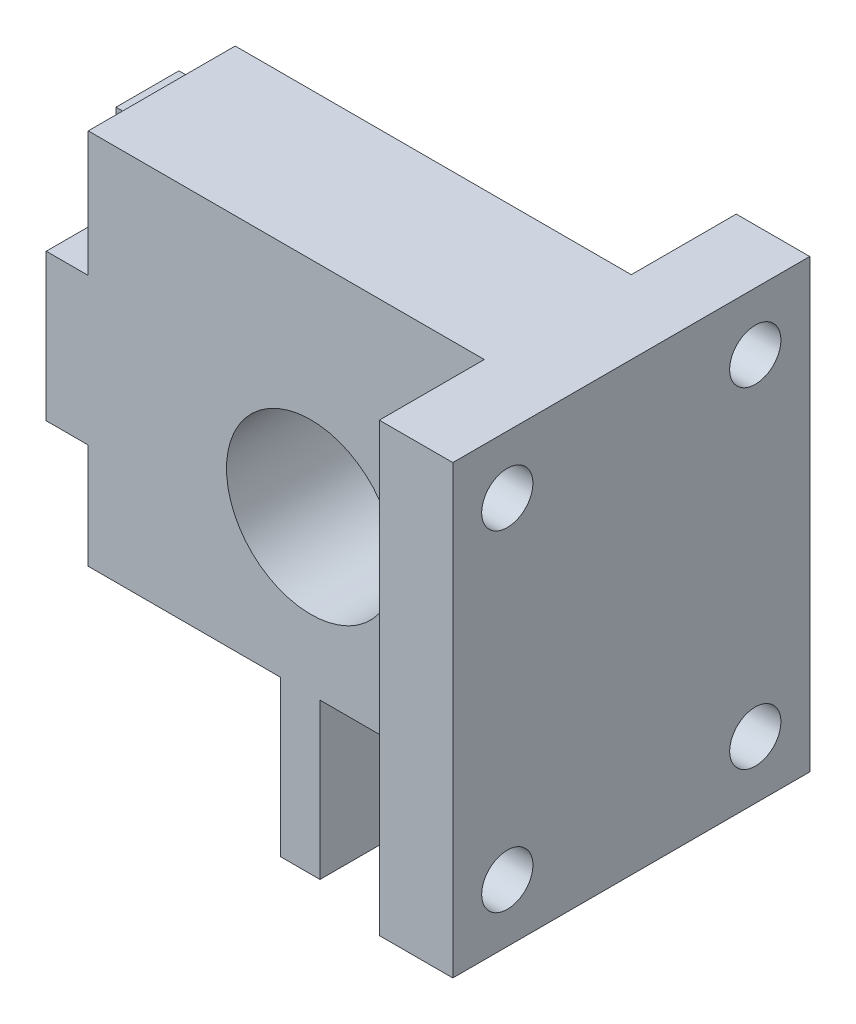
ISO-10303-21;
HEADER;
FILE_DESCRIPTION(('STEP AP214'),'2;1');
FILE_NAME('part.step','',(''),(''),'','','');
FILE_SCHEMA(('AUTOMOTIVE_DESIGN { 1 0 10303 214 1 1 1 1 }'));
ENDSEC;
DATA;
#1=APPLICATION_CONTEXT('core data for automotive mechanical design processes');
#2=APPLICATION_PROTOCOL_DEFINITION('international standard','automotive_design',2000,#1);
#3=PRODUCT_CONTEXT('',#1,'mechanical');
#4=PRODUCT('Part','Part','',(#3));
#5=PRODUCT_RELATED_PRODUCT_CATEGORY('part','',(#4));
#6=PRODUCT_DEFINITION_FORMATION('','',#4);
#7=PRODUCT_DEFINITION_CONTEXT('part definition',#1,'design');
#8=PRODUCT_DEFINITION('design','',#6,#7);
#9=PRODUCT_DEFINITION_SHAPE('','',#8);
#10=(LENGTH_UNIT() NAMED_UNIT(*) SI_UNIT(.MILLI.,.METRE.));
#11=(NAMED_UNIT(*) PLANE_ANGLE_UNIT() SI_UNIT($,.RADIAN.));
#12=(NAMED_UNIT(*) SI_UNIT($,.STERADIAN.) SOLID_ANGLE_UNIT());
#13=UNCERTAINTY_MEASURE_WITH_UNIT(LENGTH_MEASURE(1.E-05),#10,'distance_accuracy_value','');
#14=(GEOMETRIC_REPRESENTATION_CONTEXT(3) GLOBAL_UNCERTAINTY_ASSIGNED_CONTEXT((#13)) GLOBAL_UNIT_ASSIGNED_CONTEXT((#10,
#11,#12)) REPRESENTATION_CONTEXT('',''));
#15=CARTESIAN_POINT('',(0.,0.,0.));
#16=DIRECTION('',(0.,0.,1.));
#17=DIRECTION('',(1.,0.,0.));
#18=AXIS2_PLACEMENT_3D('',#15,#16,#17);
#19=CARTESIAN_POINT('',(3.9624,-2.9591,-4.572));
#20=DIRECTION('',(1.,0.,0.));
#21=DIRECTION('',(0.,0.,-1.));
#22=AXIS2_PLACEMENT_3D('',#19,#20,#21);
#23=PLANE('',#22);
#24=DIRECTION('',(0.,-1.,0.));
#25=VECTOR('',#24,1.);
#26=CARTESIAN_POINT('',(3.9624,5.92582,-0.762));
#27=LINE('',#26,#25);
#28=CARTESIAN_POINT('',(3.9624,5.92582,-0.762));
#29=VERTEX_POINT('',#28);
#30=CARTESIAN_POINT('',(3.9624,-2.9591,-0.762));
#31=VERTEX_POINT('',#30);
#32=EDGE_CURVE('E184',#29,#31,#27,.T.);
#33=ORIENTED_EDGE('',*,*,#32,.F.);
#34=DIRECTION('',(0.,0.,1.));
#35=VECTOR('',#34,1.);
#36=CARTESIAN_POINT('',(3.9624,5.92582,-4.572));
#37=LINE('',#36,#35);
#38=CARTESIAN_POINT('',(3.9624,5.92582,-4.572));
#39=VERTEX_POINT('',#38);
#40=EDGE_CURVE('E206',#39,#29,#37,.T.);
#41=ORIENTED_EDGE('',*,*,#40,.F.);
#42=DIRECTION('',(0.,1.,0.));
#43=VECTOR('',#42,1.);
#44=CARTESIAN_POINT('',(3.9624,-2.9591,-4.572));
#45=LINE('',#44,#43);
#46=CARTESIAN_POINT('',(3.9624,-2.9591,-4.572));
#47=VERTEX_POINT('',#46);
#48=EDGE_CURVE('E204',#47,#39,#45,.T.);
#49=ORIENTED_EDGE('',*,*,#48,.F.);
#50=DIRECTION('',(0.,0.,1.));
#51=VECTOR('',#50,1.);
#52=CARTESIAN_POINT('',(3.9624,-2.9591,-4.572));
#53=LINE('',#52,#51);
#54=EDGE_CURVE('E197',#47,#31,#53,.T.);
#55=ORIENTED_EDGE('',*,*,#54,.T.);
#56=EDGE_LOOP('',(#33,#41,#49,#55));
#57=FACE_BOUND('',#56,.T.);
#58=ADVANCED_FACE('F33',(#57),#23,.F.);
#59=CARTESIAN_POINT('',(-9.271,-13.5001,0.));
#60=DIRECTION('',(0.,0.,1.));
#61=DIRECTION('',(1.,0.,0.));
#62=AXIS2_PLACEMENT_3D('',#59,#60,#61);
#63=PLANE('',#62);
#64=CARTESIAN_POINT('',(25.4,0.,0.));
#65=DIRECTION('',(0.,0.,1.));
#66=DIRECTION('',(1.,0.,0.));
#67=AXIS2_PLACEMENT_3D('',#64,#65,#66);
#68=CIRCLE('',#67,5.1);
#69=CARTESIAN_POINT('',(30.5,0.,0.));
#70=VERTEX_POINT('',#69);
#71=EDGE_CURVE('E453',#70,#70,#68,.T.);
#72=ORIENTED_EDGE('',*,*,#71,.T.);
#73=EDGE_LOOP('',(#72));
#74=FACE_BOUND('',#73,.T.);
#75=DIRECTION('',(-1.,0.,0.));
#76=VECTOR('',#75,1.);
#77=CARTESIAN_POINT('',(15.748,-2.9591,0.));
#78=LINE('',#77,#76);
#79=CARTESIAN_POINT('',(15.748,-2.9591,0.));
#80=VERTEX_POINT('',#79);
#81=CARTESIAN_POINT('',(11.938,-2.9591,0.));
#82=VERTEX_POINT('',#81);
#83=EDGE_CURVE('E218',#80,#82,#78,.T.);
#84=ORIENTED_EDGE('',*,*,#83,.F.);
#85=DIRECTION('',(0.,-1.,0.));
#86=VECTOR('',#85,1.);
#87=CARTESIAN_POINT('',(15.748,-2.9591,0.));
#88=LINE('',#87,#86);
#89=CARTESIAN_POINT('',(15.748,5.92582,0.));
#90=VERTEX_POINT('',#89);
#91=EDGE_CURVE('E238',#90,#80,#88,.T.);
#92=ORIENTED_EDGE('',*,*,#91,.F.);
#93=DIRECTION('',(1.,0.,0.));
#94=VECTOR('',#93,1.);
#95=CARTESIAN_POINT('',(15.748,5.92582,0.));
#96=LINE('',#95,#94);
#97=CARTESIAN_POINT('',(11.938,5.92582,0.));
#98=VERTEX_POINT('',#97);
#99=EDGE_CURVE('E214',#98,#90,#96,.T.);
#100=ORIENTED_EDGE('',*,*,#99,.F.);
#101=DIRECTION('',(0.,1.,0.));
#102=VECTOR('',#101,1.);
#103=CARTESIAN_POINT('',(11.938,-13.5001,0.));
#104=LINE('',#103,#102);
#105=CARTESIAN_POINT('',(11.938,13.5001,0.));
#106=VERTEX_POINT('',#105);
#107=EDGE_CURVE('E488',#98,#106,#104,.T.);
#108=ORIENTED_EDGE('',*,*,#107,.T.);
#109=DIRECTION('',(-1.,0.,0.));
#110=VECTOR('',#109,1.);
#111=CARTESIAN_POINT('',(-9.271,13.5001,0.));
#112=LINE('',#111,#110);
#113=CARTESIAN_POINT('',(35.895,13.5001,0.));
#114=VERTEX_POINT('',#113);
#115=EDGE_CURVE('E469',#114,#106,#112,.T.);
#116=ORIENTED_EDGE('',*,*,#115,.F.);
#117=DIRECTION('',(0.,1.,0.));
#118=VECTOR('',#117,1.);
#119=CARTESIAN_POINT('',(35.895,-13.5001,0.));
#120=LINE('',#119,#118);
#121=CARTESIAN_POINT('',(35.895,-13.5001,0.));
#122=VERTEX_POINT('',#121);
#123=EDGE_CURVE('E439',#122,#114,#120,.T.);
#124=ORIENTED_EDGE('',*,*,#123,.F.);
#125=DIRECTION('',(1.,0.,0.));
#126=VECTOR('',#125,1.);
#127=CARTESIAN_POINT('',(-9.271,-13.5001,0.));
#128=LINE('',#127,#126);
#129=CARTESIAN_POINT('',(32.385,-13.5001,0.));
#130=VERTEX_POINT('',#129);
#131=EDGE_CURVE('E459',#130,#122,#128,.T.);
#132=ORIENTED_EDGE('',*,*,#131,.F.);
#133=DIRECTION('',(0.,-1.,0.));
#134=VECTOR('',#133,1.);
#135=CARTESIAN_POINT('',(32.385,-9.3091,0.));
#136=LINE('',#135,#134);
#137=CARTESIAN_POINT('',(32.385,-9.3091,0.));
#138=VERTEX_POINT('',#137);
#139=EDGE_CURVE('E568',#138,#130,#136,.T.);
#140=ORIENTED_EDGE('',*,*,#139,.F.);
#141=DIRECTION('',(1.,0.,0.));
#142=VECTOR('',#141,1.);
#143=CARTESIAN_POINT('',(32.385,-9.3091,0.));
#144=LINE('',#143,#142);
#145=CARTESIAN_POINT('',(25.955625,-9.3091,0.));
#146=VERTEX_POINT('',#145);
#147=EDGE_CURVE('E567',#146,#138,#144,.T.);
#148=ORIENTED_EDGE('',*,*,#147,.F.);
#149=DIRECTION('',(0.,1.,0.));
#150=VECTOR('',#149,1.);
#151=CARTESIAN_POINT('',(25.955625,-18.7071,0.));
#152=LINE('',#151,#150);
#153=CARTESIAN_POINT('',(25.955625,-18.7071,0.));
#154=VERTEX_POINT('',#153);
#155=EDGE_CURVE('E573',#154,#146,#152,.T.);
#156=ORIENTED_EDGE('',*,*,#155,.F.);
#157=DIRECTION('',(1.,0.,0.));
#158=VECTOR('',#157,1.);
#159=CARTESIAN_POINT('',(23.574375,-18.7071,0.));
#160=LINE('',#159,#158);
#161=CARTESIAN_POINT('',(23.574375,-18.7071,0.));
#162=VERTEX_POINT('',#161);
#163=EDGE_CURVE('E587',#162,#154,#160,.T.);
#164=ORIENTED_EDGE('',*,*,#163,.F.);
#165=DIRECTION('',(0.,1.,0.));
#166=VECTOR('',#165,1.);
#167=CARTESIAN_POINT('',(23.574375,-18.7071,0.));
#168=LINE('',#167,#166);
#169=CARTESIAN_POINT('',(23.574375,-9.3091,0.));
#170=VERTEX_POINT('',#169);
#171=EDGE_CURVE('E570',#162,#170,#168,.T.);
#172=ORIENTED_EDGE('',*,*,#171,.T.);
#173=CARTESIAN_POINT('',(11.938,-9.3091,0.));
#174=VERTEX_POINT('',#173);
#175=EDGE_CURVE('E565',#174,#170,#144,.T.);
#176=ORIENTED_EDGE('',*,*,#175,.F.);
#177=EDGE_CURVE('E497',#174,#82,#104,.T.);
#178=ORIENTED_EDGE('',*,*,#177,.T.);
#179=EDGE_LOOP('',(#84,#92,#100,#108,#116,#124,#132,#140,#148,#156,#164,#172,#176,#178));
#180=FACE_BOUND('',#179,.T.);
#181=ADVANCED_FACE('F262',(#74,#180),#63,.F.);
#182=CARTESIAN_POINT('',(11.938,-9.3091,-6.35));
#183=DIRECTION('',(1.,0.,0.));
#184=DIRECTION('',(0.,1.,0.));
#185=AXIS2_PLACEMENT_3D('',#182,#183,#184);
#186=PLANE('',#185);
#187=CARTESIAN_POINT('',(11.938,9.7016374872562,4.445));
#188=DIRECTION('',(-1.,0.,0.));
#189=DIRECTION('',(0.,0.,1.));
#190=AXIS2_PLACEMENT_3D('',#187,#188,#189);
#191=CIRCLE('',#190,1.28905);
#192=CARTESIAN_POINT('',(11.938,9.7016374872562,5.73405));
#193=VERTEX_POINT('',#192);
#194=EDGE_CURVE('E305',#193,#193,#191,.T.);
#195=ORIENTED_EDGE('',*,*,#194,.F.);
#196=EDGE_LOOP('',(#195));
#197=FACE_BOUND('',#196,.T.);
#198=DIRECTION('',(0.,0.,-1.));
#199=VECTOR('',#198,1.);
#200=CARTESIAN_POINT('',(11.938,5.92582,0.));
#201=LINE('',#200,#199);
#202=CARTESIAN_POINT('',(11.938,5.92582,8.89));
#203=VERTEX_POINT('',#202);
#204=EDGE_CURVE('E58',#203,#98,#201,.T.);
#205=ORIENTED_EDGE('',*,*,#204,.F.);
#206=DIRECTION('',(0.,1.,0.));
#207=VECTOR('',#206,1.);
#208=CARTESIAN_POINT('',(11.938,-9.3091,8.89));
#209=LINE('',#208,#207);
#210=CARTESIAN_POINT('',(11.938,13.5001,8.89));
#211=VERTEX_POINT('',#210);
#212=EDGE_CURVE('E477',#203,#211,#209,.T.);
#213=ORIENTED_EDGE('',*,*,#212,.T.);
#214=DIRECTION('',(0.,0.,1.));
#215=VECTOR('',#214,1.);
#216=CARTESIAN_POINT('',(11.938,13.5001,-6.35));
#217=LINE('',#216,#215);
#218=EDGE_CURVE('E484',#106,#211,#217,.T.);
#219=ORIENTED_EDGE('',*,*,#218,.F.);
#220=ORIENTED_EDGE('',*,*,#107,.F.);
#221=EDGE_LOOP('',(#205,#213,#219,#220));
#222=FACE_BOUND('',#221,.T.);
#223=ADVANCED_FACE('F266',(#197,#222),#186,.F.);
#224=CARTESIAN_POINT('',(11.938,-6.14144391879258,4.445));
#225=DIRECTION('',(-1.,0.,0.));
#226=DIRECTION('',(0.,0.,1.));
#227=AXIS2_PLACEMENT_3D('',#224,#225,#226);
#228=CIRCLE('',#227,1.28905);
#229=CARTESIAN_POINT('',(11.938,-6.14144391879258,5.73405));
#230=VERTEX_POINT('',#229);
#231=EDGE_CURVE('E297',#230,#230,#228,.T.);
#232=ORIENTED_EDGE('',*,*,#231,.F.);
#233=EDGE_LOOP('',(#232));
#234=FACE_BOUND('',#233,.T.);
#235=DIRECTION('',(0.,0.,1.));
#236=VECTOR('',#235,1.);
#237=CARTESIAN_POINT('',(11.938,-2.9591,0.));
#238=LINE('',#237,#236);
#239=CARTESIAN_POINT('',(11.938,-2.9591,8.89));
#240=VERTEX_POINT('',#239);
#241=EDGE_CURVE('E208',#82,#240,#238,.T.);
#242=ORIENTED_EDGE('',*,*,#241,.F.);
#243=ORIENTED_EDGE('',*,*,#177,.F.);
#244=DIRECTION('',(0.,0.,1.));
#245=VECTOR('',#244,1.);
#246=CARTESIAN_POINT('',(11.938,-9.3091,-6.35));
#247=LINE('',#246,#245);
#248=CARTESIAN_POINT('',(11.938,-9.3091,8.89));
#249=VERTEX_POINT('',#248);
#250=EDGE_CURVE('E476',#174,#249,#247,.T.);
#251=ORIENTED_EDGE('',*,*,#250,.T.);
#252=EDGE_CURVE('E473',#249,#240,#209,.T.);
#253=ORIENTED_EDGE('',*,*,#252,.T.);
#254=EDGE_LOOP('',(#242,#243,#251,#253));
#255=FACE_BOUND('',#254,.T.);
#256=ADVANCED_FACE('F319',(#234,#255),#186,.F.);
#257=CARTESIAN_POINT('',(32.385,-9.3091,15.240025));
#258=DIRECTION('',(0.,1.,0.));
#259=DIRECTION('',(0.,0.,1.));
#260=AXIS2_PLACEMENT_3D('',#257,#258,#259);
#261=PLANE('',#260);
#262=DIRECTION('',(-1.,0.,0.));
#263=VECTOR('',#262,1.);
#264=CARTESIAN_POINT('',(-9.271,-9.3091,8.89));
#265=LINE('',#264,#263);
#266=CARTESIAN_POINT('',(23.574375,-9.3091,8.89));
#267=VERTEX_POINT('',#266);
#268=EDGE_CURVE('E425',#267,#249,#265,.T.);
#269=ORIENTED_EDGE('',*,*,#268,.T.);
#270=ORIENTED_EDGE('',*,*,#250,.F.);
#271=ORIENTED_EDGE('',*,*,#175,.T.);
#272=DIRECTION('',(0.,0.,-1.));
#273=VECTOR('',#272,1.);
#274=CARTESIAN_POINT('',(23.574375,-9.3091,8.89));
#275=LINE('',#274,#273);
#276=EDGE_CURVE('E499',#267,#170,#275,.T.);
#277=ORIENTED_EDGE('',*,*,#276,.F.);
#278=EDGE_LOOP('',(#269,#270,#271,#277));
#279=FACE_BOUND('',#278,.T.);
#280=ADVANCED_FACE('F324',(#279),#261,.F.);
#281=DIRECTION('',(0.,0.,1.));
#282=VECTOR('',#281,1.);
#283=CARTESIAN_POINT('',(25.955625,-9.3091,8.89));
#284=LINE('',#283,#282);
#285=CARTESIAN_POINT('',(25.955625,-9.3091,8.89));
#286=VERTEX_POINT('',#285);
#287=EDGE_CURVE('E503',#146,#286,#284,.T.);
#288=ORIENTED_EDGE('',*,*,#287,.F.);
#289=ORIENTED_EDGE('',*,*,#147,.T.);
#290=DIRECTION('',(0.,0.,-1.));
#291=VECTOR('',#290,1.);
#292=CARTESIAN_POINT('',(32.385,-9.3091,15.240025));
#293=LINE('',#292,#291);
#294=CARTESIAN_POINT('',(32.385,-9.3091,8.89));
#295=VERTEX_POINT('',#294);
#296=EDGE_CURVE('E562',#295,#138,#293,.T.);
#297=ORIENTED_EDGE('',*,*,#296,.F.);
#298=EDGE_CURVE('E42',#295,#286,#265,.T.);
#299=ORIENTED_EDGE('',*,*,#298,.T.);
#300=EDGE_LOOP('',(#288,#289,#297,#299));
#301=FACE_BOUND('',#300,.T.);
#302=ADVANCED_FACE('F344',(#301),#261,.F.);
#303=CARTESIAN_POINT('',(-9.271,-13.5001,8.89));
#304=DIRECTION('',(0.,1.,0.));
#305=DIRECTION('',(0.,0.,1.));
#306=AXIS2_PLACEMENT_3D('',#303,#304,#305);
#307=PLANE('',#306);
#308=DIRECTION('',(1.,0.,0.));
#309=VECTOR('',#308,1.);
#310=CARTESIAN_POINT('',(-9.271,-13.5001,8.89));
#311=LINE('',#310,#309);
#312=CARTESIAN_POINT('',(32.385,-13.5001,8.89));
#313=VERTEX_POINT('',#312);
#314=CARTESIAN_POINT('',(35.895,-13.5001,8.89));
#315=VERTEX_POINT('',#314);
#316=EDGE_CURVE('E465',#313,#315,#311,.T.);
#317=ORIENTED_EDGE('',*,*,#316,.F.);
#318=DIRECTION('',(0.,0.,-1.));
#319=VECTOR('',#318,1.);
#320=CARTESIAN_POINT('',(32.385,-13.5001,8.89));
#321=LINE('',#320,#319);
#322=EDGE_CURVE('E539',#313,#130,#321,.T.);
#323=ORIENTED_EDGE('',*,*,#322,.T.);
#324=ORIENTED_EDGE('',*,*,#131,.T.);
#325=DIRECTION('',(0.,0.,1.));
#326=VECTOR('',#325,1.);
#327=CARTESIAN_POINT('',(35.895,-13.5001,-6.35));
#328=LINE('',#327,#326);
#329=CARTESIAN_POINT('',(35.895,-13.5001,-6.35));
#330=VERTEX_POINT('',#329);
#331=EDGE_CURVE('E432',#330,#122,#328,.T.);
#332=ORIENTED_EDGE('',*,*,#331,.F.);
#333=DIRECTION('',(-1.,0.,0.));
#334=VECTOR('',#333,1.);
#335=CARTESIAN_POINT('',(40.34,-13.5001,-6.35));
#336=LINE('',#335,#334);
#337=CARTESIAN_POINT('',(40.34,-13.5001,-6.35));
#338=VERTEX_POINT('',#337);
#339=EDGE_CURVE('E429',#338,#330,#336,.T.);
#340=ORIENTED_EDGE('',*,*,#339,.F.);
#341=DIRECTION('',(0.,0.,-1.));
#342=VECTOR('',#341,1.);
#343=CARTESIAN_POINT('',(40.34,-13.5001,8.89));
#344=LINE('',#343,#342);
#345=CARTESIAN_POINT('',(40.34,-13.5001,15.24));
#346=VERTEX_POINT('',#345);
#347=EDGE_CURVE('E417',#346,#338,#344,.T.);
#348=ORIENTED_EDGE('',*,*,#347,.F.);
#349=DIRECTION('',(1.,0.,0.));
#350=VECTOR('',#349,1.);
#351=CARTESIAN_POINT('',(40.34,-13.5001,15.24));
#352=LINE('',#351,#350);
#353=CARTESIAN_POINT('',(35.895,-13.5001,15.24));
#354=VERTEX_POINT('',#353);
#355=EDGE_CURVE('E522',#354,#346,#352,.T.);
#356=ORIENTED_EDGE('',*,*,#355,.F.);
#357=DIRECTION('',(0.,0.,-1.));
#358=VECTOR('',#357,1.);
#359=CARTESIAN_POINT('',(35.895,-13.5001,15.24));
#360=LINE('',#359,#358);
#361=EDGE_CURVE('E519',#354,#315,#360,.T.);
#362=ORIENTED_EDGE('',*,*,#361,.T.);
#363=EDGE_LOOP('',(#317,#323,#324,#332,#340,#348,#356,#362));
#364=FACE_BOUND('',#363,.T.);
#365=ADVANCED_FACE('F35',(#364),#307,.F.);
#366=CARTESIAN_POINT('',(40.34,13.5001,8.89));
#367=DIRECTION('',(-1.,0.,0.));
#368=DIRECTION('',(0.,0.,1.));
#369=AXIS2_PLACEMENT_3D('',#366,#367,#368);
#370=PLANE('',#369);
#371=CARTESIAN_POINT('',(40.34,10.,-3.055));
#372=DIRECTION('',(-1.,0.,0.));
#373=DIRECTION('',(0.,0.,1.));
#374=AXIS2_PLACEMENT_3D('',#371,#372,#373);
#375=CIRCLE('',#374,1.55);
#376=CARTESIAN_POINT('',(40.34,10.,-1.505));
#377=VERTEX_POINT('',#376);
#378=EDGE_CURVE('E402',#377,#377,#375,.T.);
#379=ORIENTED_EDGE('',*,*,#378,.T.);
#380=EDGE_LOOP('',(#379));
#381=FACE_BOUND('',#380,.T.);
#382=CARTESIAN_POINT('',(40.34,-10.,-3.055));
#383=DIRECTION('',(-1.,0.,0.));
#384=DIRECTION('',(0.,0.,1.));
#385=AXIS2_PLACEMENT_3D('',#382,#383,#384);
#386=CIRCLE('',#385,1.55);
#387=CARTESIAN_POINT('',(40.34,-10.,-1.505));
#388=VERTEX_POINT('',#387);
#389=EDGE_CURVE('E406',#388,#388,#386,.T.);
#390=ORIENTED_EDGE('',*,*,#389,.T.);
#391=EDGE_LOOP('',(#390));
#392=FACE_BOUND('',#391,.T.);
#393=CARTESIAN_POINT('',(40.34,10.,11.945));
#394=DIRECTION('',(-1.,0.,0.));
#395=DIRECTION('',(0.,0.,1.));
#396=AXIS2_PLACEMENT_3D('',#393,#394,#395);
#397=CIRCLE('',#396,1.55);
#398=CARTESIAN_POINT('',(40.34,10.,13.495));
#399=VERTEX_POINT('',#398);
#400=EDGE_CURVE('E410',#399,#399,#397,.T.);
#401=ORIENTED_EDGE('',*,*,#400,.T.);
#402=EDGE_LOOP('',(#401));
#403=FACE_BOUND('',#402,.T.);
#404=CARTESIAN_POINT('',(40.34,-10.,11.945));
#405=DIRECTION('',(-1.,0.,0.));
#406=DIRECTION('',(0.,0.,1.));
#407=AXIS2_PLACEMENT_3D('',#404,#405,#406);
#408=CIRCLE('',#407,1.55);
#409=CARTESIAN_POINT('',(40.34,-10.,13.495));
#410=VERTEX_POINT('',#409);
#411=EDGE_CURVE('E414',#410,#410,#408,.T.);
#412=ORIENTED_EDGE('',*,*,#411,.T.);
#413=EDGE_LOOP('',(#412));
#414=FACE_BOUND('',#413,.T.);
#415=ORIENTED_EDGE('',*,*,#347,.T.);
#416=DIRECTION('',(0.,-1.,0.));
#417=VECTOR('',#416,1.);
#418=CARTESIAN_POINT('',(40.34,-13.5001,-6.35));
#419=LINE('',#418,#417);
#420=CARTESIAN_POINT('',(40.34,13.5001,-6.35));
#421=VERTEX_POINT('',#420);
#422=EDGE_CURVE('E420',#421,#338,#419,.T.);
#423=ORIENTED_EDGE('',*,*,#422,.F.);
#424=DIRECTION('',(0.,0.,-1.));
#425=VECTOR('',#424,1.);
#426=CARTESIAN_POINT('',(40.34,13.5001,8.89));
#427=LINE('',#426,#425);
#428=CARTESIAN_POINT('',(40.34,13.5001,15.24));
#429=VERTEX_POINT('',#428);
#430=EDGE_CURVE('E426',#429,#421,#427,.T.);
#431=ORIENTED_EDGE('',*,*,#430,.F.);
#432=DIRECTION('',(0.,1.,0.));
#433=VECTOR('',#432,1.);
#434=CARTESIAN_POINT('',(40.34,13.5001,15.24));
#435=LINE('',#434,#433);
#436=EDGE_CURVE('E422',#346,#429,#435,.T.);
#437=ORIENTED_EDGE('',*,*,#436,.F.);
#438=EDGE_LOOP('',(#415,#423,#431,#437));
#439=FACE_BOUND('',#438,.T.);
#440=ADVANCED_FACE('F391',(#381,#392,#403,#414,#439),#370,.F.);
#441=CARTESIAN_POINT('',(-9.271,13.5001,8.89));
#442=DIRECTION('',(0.,-1.,0.));
#443=DIRECTION('',(0.,0.,-1.));
#444=AXIS2_PLACEMENT_3D('',#441,#442,#443);
#445=PLANE('',#444);
#446=ORIENTED_EDGE('',*,*,#115,.T.);
#447=ORIENTED_EDGE('',*,*,#218,.T.);
#448=DIRECTION('',(-1.,0.,0.));
#449=VECTOR('',#448,1.);
#450=CARTESIAN_POINT('',(-9.271,13.5001,8.89));
#451=LINE('',#450,#449);
#452=CARTESIAN_POINT('',(35.895,13.5001,8.89));
#453=VERTEX_POINT('',#452);
#454=EDGE_CURVE('E468',#453,#211,#451,.T.);
#455=ORIENTED_EDGE('',*,*,#454,.F.);
#456=DIRECTION('',(0.,0.,-1.));
#457=VECTOR('',#456,1.);
#458=CARTESIAN_POINT('',(35.895,13.5001,15.24));
#459=LINE('',#458,#457);
#460=CARTESIAN_POINT('',(35.895,13.5001,15.24));
#461=VERTEX_POINT('',#460);
#462=EDGE_CURVE('E442',#461,#453,#459,.T.);
#463=ORIENTED_EDGE('',*,*,#462,.F.);
#464=DIRECTION('',(-1.,0.,0.));
#465=VECTOR('',#464,1.);
#466=CARTESIAN_POINT('',(40.34,13.5001,15.24));
#467=LINE('',#466,#465);
#468=EDGE_CURVE('E531',#429,#461,#467,.T.);
#469=ORIENTED_EDGE('',*,*,#468,.F.);
#470=ORIENTED_EDGE('',*,*,#430,.T.);
#471=DIRECTION('',(1.,0.,0.));
#472=VECTOR('',#471,1.);
#473=CARTESIAN_POINT('',(40.34,13.5001,-6.35));
#474=LINE('',#473,#472);
#475=CARTESIAN_POINT('',(35.895,13.5001,-6.35));
#476=VERTEX_POINT('',#475);
#477=EDGE_CURVE('E438',#476,#421,#474,.T.);
#478=ORIENTED_EDGE('',*,*,#477,.F.);
#479=DIRECTION('',(0.,0.,1.));
#480=VECTOR('',#479,1.);
#481=CARTESIAN_POINT('',(35.895,13.5001,-6.35));
#482=LINE('',#481,#480);
#483=EDGE_CURVE('E449',#476,#114,#482,.T.);
#484=ORIENTED_EDGE('',*,*,#483,.T.);
#485=EDGE_LOOP('',(#446,#447,#455,#463,#469,#470,#478,#484));
#486=FACE_BOUND('',#485,.T.);
#487=ADVANCED_FACE('F387',(#486),#445,.F.);
#488=CARTESIAN_POINT('',(-9.271,-13.5001,8.89));
#489=DIRECTION('',(0.,0.,1.));
#490=DIRECTION('',(1.,0.,0.));
#491=AXIS2_PLACEMENT_3D('',#488,#489,#490);
#492=PLANE('',#491);
#493=ORIENTED_EDGE('',*,*,#252,.F.);
#494=ORIENTED_EDGE('',*,*,#268,.F.);
#495=DIRECTION('',(0.,1.,0.));
#496=VECTOR('',#495,1.);
#497=CARTESIAN_POINT('',(23.574375,-18.7071,8.89));
#498=LINE('',#497,#496);
#499=CARTESIAN_POINT('',(23.574375,-18.7071,8.89));
#500=VERTEX_POINT('',#499);
#501=EDGE_CURVE('E579',#500,#267,#498,.T.);
#502=ORIENTED_EDGE('',*,*,#501,.F.);
#503=DIRECTION('',(-1.,0.,0.));
#504=VECTOR('',#503,1.);
#505=CARTESIAN_POINT('',(23.574375,-18.7071,8.89));
#506=LINE('',#505,#504);
#507=CARTESIAN_POINT('',(25.955625,-18.7071,8.89));
#508=VERTEX_POINT('',#507);
#509=EDGE_CURVE('E582',#508,#500,#506,.T.);
#510=ORIENTED_EDGE('',*,*,#509,.F.);
#511=DIRECTION('',(0.,1.,0.));
#512=VECTOR('',#511,1.);
#513=CARTESIAN_POINT('',(25.955625,-18.7071,8.89));
#514=LINE('',#513,#512);
#515=EDGE_CURVE('E576',#508,#286,#514,.T.);
#516=ORIENTED_EDGE('',*,*,#515,.T.);
#517=ORIENTED_EDGE('',*,*,#298,.F.);
#518=DIRECTION('',(0.,1.,0.));
#519=VECTOR('',#518,1.);
#520=CARTESIAN_POINT('',(32.385,-13.5001,8.89));
#521=LINE('',#520,#519);
#522=EDGE_CURVE('E11',#313,#295,#521,.T.);
#523=ORIENTED_EDGE('',*,*,#522,.F.);
#524=ORIENTED_EDGE('',*,*,#316,.T.);
#525=DIRECTION('',(0.,-1.,0.));
#526=VECTOR('',#525,1.);
#527=CARTESIAN_POINT('',(35.895,13.5001,8.89));
#528=LINE('',#527,#526);
#529=EDGE_CURVE('E516',#453,#315,#528,.T.);
#530=ORIENTED_EDGE('',*,*,#529,.F.);
#531=ORIENTED_EDGE('',*,*,#454,.T.);
#532=ORIENTED_EDGE('',*,*,#212,.F.);
#533=DIRECTION('',(1.,0.,0.));
#534=VECTOR('',#533,1.);
#535=CARTESIAN_POINT('',(9.398,5.92582,8.89));
#536=LINE('',#535,#534);
#537=CARTESIAN_POINT('',(9.398,5.92582,8.89));
#538=VERTEX_POINT('',#537);
#539=EDGE_CURVE('E611',#538,#203,#536,.T.);
#540=ORIENTED_EDGE('',*,*,#539,.F.);
#541=DIRECTION('',(0.,1.,0.));
#542=VECTOR('',#541,1.);
#543=CARTESIAN_POINT('',(9.398,-2.9591,8.89));
#544=LINE('',#543,#542);
#545=CARTESIAN_POINT('',(9.398,-2.9591,8.89));
#546=VERTEX_POINT('',#545);
#547=EDGE_CURVE('E612',#546,#538,#544,.T.);
#548=ORIENTED_EDGE('',*,*,#547,.F.);
#549=DIRECTION('',(1.,0.,0.));
#550=VECTOR('',#549,1.);
#551=CARTESIAN_POINT('',(9.398,-2.9591,8.89));
#552=LINE('',#551,#550);
#553=EDGE_CURVE('E605',#546,#240,#552,.T.);
#554=ORIENTED_EDGE('',*,*,#553,.T.);
#555=EDGE_LOOP('',(#493,#494,#502,#510,#516,#517,#523,#524,#530,#531,#532,#540,#548,#554));
#556=FACE_BOUND('',#555,.T.);
#557=CARTESIAN_POINT('',(25.4,0.,8.89));
#558=DIRECTION('',(0.,0.,1.));
#559=DIRECTION('',(1.,0.,0.));
#560=AXIS2_PLACEMENT_3D('',#557,#558,#559);
#561=CIRCLE('',#560,5.1);
#562=CARTESIAN_POINT('',(30.5,0.,8.89));
#563=VERTEX_POINT('',#562);
#564=EDGE_CURVE('E456',#563,#563,#561,.T.);
#565=ORIENTED_EDGE('',*,*,#564,.F.);
#566=EDGE_LOOP('',(#565));
#567=FACE_BOUND('',#566,.T.);
#568=ADVANCED_FACE('F384',(#556,#567),#492,.T.);
#569=CARTESIAN_POINT('',(25.4,0.,8.89));
#570=DIRECTION('',(0.,0.,1.));
#571=DIRECTION('',(1.,0.,0.));
#572=AXIS2_PLACEMENT_3D('',#569,#570,#571);
#573=CYLINDRICAL_SURFACE('',#572,5.1);
#574=ORIENTED_EDGE('',*,*,#71,.F.);
#575=EDGE_LOOP('',(#574));
#576=FACE_BOUND('',#575,.T.);
#577=ORIENTED_EDGE('',*,*,#564,.T.);
#578=EDGE_LOOP('',(#577));
#579=FACE_BOUND('',#578,.T.);
#580=ADVANCED_FACE('F380',(#576,#579),#573,.F.);
#581=CARTESIAN_POINT('',(35.895,-13.5001,-6.35));
#582=DIRECTION('',(1.,0.,0.));
#583=DIRECTION('',(0.,0.,-1.));
#584=AXIS2_PLACEMENT_3D('',#581,#582,#583);
#585=PLANE('',#584);
#586=CARTESIAN_POINT('',(35.895,10.,-3.055));
#587=DIRECTION('',(-1.,0.,0.));
#588=DIRECTION('',(0.,0.,1.));
#589=AXIS2_PLACEMENT_3D('',#586,#587,#588);
#590=CIRCLE('',#589,1.54999999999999);
#591=CARTESIAN_POINT('',(35.895,10.,-1.50500000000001));
#592=VERTEX_POINT('',#591);
#593=EDGE_CURVE('E558',#592,#592,#590,.T.);
#594=ORIENTED_EDGE('',*,*,#593,.F.);
#595=EDGE_LOOP('',(#594));
#596=FACE_BOUND('',#595,.T.);
#597=CARTESIAN_POINT('',(35.895,-10.,-3.055));
#598=DIRECTION('',(-1.,0.,0.));
#599=DIRECTION('',(0.,0.,1.));
#600=AXIS2_PLACEMENT_3D('',#597,#598,#599);
#601=CIRCLE('',#600,1.54999999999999);
#602=CARTESIAN_POINT('',(35.895,-10.,-1.50500000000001));
#603=VERTEX_POINT('',#602);
#604=EDGE_CURVE('E554',#603,#603,#601,.T.);
#605=ORIENTED_EDGE('',*,*,#604,.F.);
#606=EDGE_LOOP('',(#605));
#607=FACE_BOUND('',#606,.T.);
#608=ORIENTED_EDGE('',*,*,#123,.T.);
#609=ORIENTED_EDGE('',*,*,#483,.F.);
#610=DIRECTION('',(0.,1.,0.));
#611=VECTOR('',#610,1.);
#612=CARTESIAN_POINT('',(35.895,-13.5001,-6.35));
#613=LINE('',#612,#611);
#614=EDGE_CURVE('E434',#330,#476,#613,.T.);
#615=ORIENTED_EDGE('',*,*,#614,.F.);
#616=ORIENTED_EDGE('',*,*,#331,.T.);
#617=EDGE_LOOP('',(#608,#609,#615,#616));
#618=FACE_BOUND('',#617,.T.);
#619=ADVANCED_FACE('F376',(#596,#607,#618),#585,.F.);
#620=CARTESIAN_POINT('',(40.34,13.5001,-6.35));
#621=DIRECTION('',(0.,0.,1.));
#622=DIRECTION('',(1.,0.,0.));
#623=AXIS2_PLACEMENT_3D('',#620,#621,#622);
#624=PLANE('',#623);
#625=ORIENTED_EDGE('',*,*,#422,.T.);
#626=ORIENTED_EDGE('',*,*,#339,.T.);
#627=ORIENTED_EDGE('',*,*,#614,.T.);
#628=ORIENTED_EDGE('',*,*,#477,.T.);
#629=EDGE_LOOP('',(#625,#626,#627,#628));
#630=FACE_BOUND('',#629,.T.);
#631=ADVANCED_FACE('F372',(#630),#624,.F.);
#632=CARTESIAN_POINT('',(35.895,13.5001,15.24));
#633=DIRECTION('',(1.,0.,0.));
#634=DIRECTION('',(0.,0.,-1.));
#635=AXIS2_PLACEMENT_3D('',#632,#633,#634);
#636=PLANE('',#635);
#637=CARTESIAN_POINT('',(35.895,10.,11.945));
#638=DIRECTION('',(-1.,0.,0.));
#639=DIRECTION('',(0.,0.,1.));
#640=AXIS2_PLACEMENT_3D('',#637,#638,#639);
#641=CIRCLE('',#640,1.54999999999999);
#642=CARTESIAN_POINT('',(35.895,10.,13.495));
#643=VERTEX_POINT('',#642);
#644=EDGE_CURVE('E550',#643,#643,#641,.T.);
#645=ORIENTED_EDGE('',*,*,#644,.F.);
#646=EDGE_LOOP('',(#645));
#647=FACE_BOUND('',#646,.T.);
#648=CARTESIAN_POINT('',(35.895,-10.,11.945));
#649=DIRECTION('',(-1.,0.,0.));
#650=DIRECTION('',(0.,0.,1.));
#651=AXIS2_PLACEMENT_3D('',#648,#649,#650);
#652=CIRCLE('',#651,1.54999999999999);
#653=CARTESIAN_POINT('',(35.895,-10.,13.495));
#654=VERTEX_POINT('',#653);
#655=EDGE_CURVE('E546',#654,#654,#652,.T.);
#656=ORIENTED_EDGE('',*,*,#655,.F.);
#657=EDGE_LOOP('',(#656));
#658=FACE_BOUND('',#657,.T.);
#659=ORIENTED_EDGE('',*,*,#529,.T.);
#660=ORIENTED_EDGE('',*,*,#361,.F.);
#661=DIRECTION('',(0.,-1.,0.));
#662=VECTOR('',#661,1.);
#663=CARTESIAN_POINT('',(35.895,13.5001,15.24));
#664=LINE('',#663,#662);
#665=EDGE_CURVE('E529',#461,#354,#664,.T.);
#666=ORIENTED_EDGE('',*,*,#665,.F.);
#667=ORIENTED_EDGE('',*,*,#462,.T.);
#668=EDGE_LOOP('',(#659,#660,#666,#667));
#669=FACE_BOUND('',#668,.T.);
#670=ADVANCED_FACE('F368',(#647,#658,#669),#636,.F.);
#671=CARTESIAN_POINT('',(40.34,-13.5001,15.24));
#672=DIRECTION('',(0.,0.,-1.));
#673=DIRECTION('',(-1.,0.,0.));
#674=AXIS2_PLACEMENT_3D('',#671,#672,#673);
#675=PLANE('',#674);
#676=ORIENTED_EDGE('',*,*,#436,.T.);
#677=ORIENTED_EDGE('',*,*,#468,.T.);
#678=ORIENTED_EDGE('',*,*,#665,.T.);
#679=ORIENTED_EDGE('',*,*,#355,.T.);
#680=EDGE_LOOP('',(#676,#677,#678,#679));
#681=FACE_BOUND('',#680,.T.);
#682=ADVANCED_FACE('F364',(#681),#675,.F.);
#683=CARTESIAN_POINT('',(35.895,-10.,11.945));
#684=DIRECTION('',(-1.,0.,0.));
#685=DIRECTION('',(0.,0.,1.));
#686=AXIS2_PLACEMENT_3D('',#683,#684,#685);
#687=CYLINDRICAL_SURFACE('',#686,1.54999999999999);
#688=ORIENTED_EDGE('',*,*,#411,.F.);
#689=EDGE_LOOP('',(#688));
#690=FACE_BOUND('',#689,.T.);
#691=ORIENTED_EDGE('',*,*,#655,.T.);
#692=EDGE_LOOP('',(#691));
#693=FACE_BOUND('',#692,.T.);
#694=ADVANCED_FACE('F360',(#690,#693),#687,.F.);
#695=CARTESIAN_POINT('',(35.895,10.,11.945));
#696=DIRECTION('',(-1.,0.,0.));
#697=DIRECTION('',(0.,0.,1.));
#698=AXIS2_PLACEMENT_3D('',#695,#696,#697);
#699=CYLINDRICAL_SURFACE('',#698,1.54999999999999);
#700=ORIENTED_EDGE('',*,*,#400,.F.);
#701=EDGE_LOOP('',(#700));
#702=FACE_BOUND('',#701,.T.);
#703=ORIENTED_EDGE('',*,*,#644,.T.);
#704=EDGE_LOOP('',(#703));
#705=FACE_BOUND('',#704,.T.);
#706=ADVANCED_FACE('F356',(#702,#705),#699,.F.);
#707=CARTESIAN_POINT('',(35.895,-10.,-3.055));
#708=DIRECTION('',(-1.,0.,0.));
#709=DIRECTION('',(0.,0.,1.));
#710=AXIS2_PLACEMENT_3D('',#707,#708,#709);
#711=CYLINDRICAL_SURFACE('',#710,1.54999999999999);
#712=ORIENTED_EDGE('',*,*,#389,.F.);
#713=EDGE_LOOP('',(#712));
#714=FACE_BOUND('',#713,.T.);
#715=ORIENTED_EDGE('',*,*,#604,.T.);
#716=EDGE_LOOP('',(#715));
#717=FACE_BOUND('',#716,.T.);
#718=ADVANCED_FACE('F352',(#714,#717),#711,.F.);
#719=CARTESIAN_POINT('',(35.895,10.,-3.055));
#720=DIRECTION('',(-1.,0.,0.));
#721=DIRECTION('',(0.,0.,1.));
#722=AXIS2_PLACEMENT_3D('',#719,#720,#721);
#723=CYLINDRICAL_SURFACE('',#722,1.54999999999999);
#724=ORIENTED_EDGE('',*,*,#378,.F.);
#725=EDGE_LOOP('',(#724));
#726=FACE_BOUND('',#725,.T.);
#727=ORIENTED_EDGE('',*,*,#593,.T.);
#728=EDGE_LOOP('',(#727));
#729=FACE_BOUND('',#728,.T.);
#730=ADVANCED_FACE('F348',(#726,#729),#723,.F.);
#731=CARTESIAN_POINT('',(32.385,-9.3091,15.240025));
#732=DIRECTION('',(1.,0.,0.));
#733=DIRECTION('',(0.,0.,-1.));
#734=AXIS2_PLACEMENT_3D('',#731,#732,#733);
#735=PLANE('',#734);
#736=ORIENTED_EDGE('',*,*,#522,.T.);
#737=ORIENTED_EDGE('',*,*,#296,.T.);
#738=ORIENTED_EDGE('',*,*,#139,.T.);
#739=ORIENTED_EDGE('',*,*,#322,.F.);
#740=EDGE_LOOP('',(#736,#737,#738,#739));
#741=FACE_BOUND('',#740,.T.);
#742=ADVANCED_FACE('F340',(#741),#735,.F.);
#743=CARTESIAN_POINT('',(23.574375,-18.7071,8.89));
#744=DIRECTION('',(1.,0.,0.));
#745=DIRECTION('',(0.,0.,-1.));
#746=AXIS2_PLACEMENT_3D('',#743,#744,#745);
#747=PLANE('',#746);
#748=ORIENTED_EDGE('',*,*,#276,.T.);
#749=ORIENTED_EDGE('',*,*,#171,.F.);
#750=DIRECTION('',(0.,0.,-1.));
#751=VECTOR('',#750,1.);
#752=CARTESIAN_POINT('',(23.574375,-18.7071,8.89));
#753=LINE('',#752,#751);
#754=EDGE_CURVE('E492',#500,#162,#753,.T.);
#755=ORIENTED_EDGE('',*,*,#754,.F.);
#756=ORIENTED_EDGE('',*,*,#501,.T.);
#757=EDGE_LOOP('',(#748,#749,#755,#756));
#758=FACE_BOUND('',#757,.T.);
#759=ADVANCED_FACE('F336',(#758),#747,.F.);
#760=CARTESIAN_POINT('',(25.955625,-18.7071,8.89));
#761=DIRECTION('',(-1.,0.,0.));
#762=DIRECTION('',(0.,-1.,0.));
#763=AXIS2_PLACEMENT_3D('',#760,#761,#762);
#764=PLANE('',#763);
#765=ORIENTED_EDGE('',*,*,#287,.T.);
#766=ORIENTED_EDGE('',*,*,#515,.F.);
#767=DIRECTION('',(0.,0.,1.));
#768=VECTOR('',#767,1.);
#769=CARTESIAN_POINT('',(25.955625,-18.7071,8.89));
#770=LINE('',#769,#768);
#771=EDGE_CURVE('E586',#154,#508,#770,.T.);
#772=ORIENTED_EDGE('',*,*,#771,.F.);
#773=ORIENTED_EDGE('',*,*,#155,.T.);
#774=EDGE_LOOP('',(#765,#766,#772,#773));
#775=FACE_BOUND('',#774,.T.);
#776=ADVANCED_FACE('F332',(#775),#764,.F.);
#777=CARTESIAN_POINT('',(23.574375,-18.7071,0.));
#778=DIRECTION('',(0.,-1.,0.));
#779=DIRECTION('',(0.,0.,-1.));
#780=AXIS2_PLACEMENT_3D('',#777,#778,#779);
#781=PLANE('',#780);
#782=ORIENTED_EDGE('',*,*,#754,.T.);
#783=ORIENTED_EDGE('',*,*,#163,.T.);
#784=ORIENTED_EDGE('',*,*,#771,.T.);
#785=ORIENTED_EDGE('',*,*,#509,.T.);
#786=EDGE_LOOP('',(#782,#783,#784,#785));
#787=FACE_BOUND('',#786,.T.);
#788=ADVANCED_FACE('F329',(#787),#781,.T.);
#789=CARTESIAN_POINT('',(9.398,-2.9591,0.));
#790=DIRECTION('',(0.,1.,0.));
#791=DIRECTION('',(0.,0.,1.));
#792=AXIS2_PLACEMENT_3D('',#789,#790,#791);
#793=PLANE('',#792);
#794=DIRECTION('',(0.,0.,1.));
#795=VECTOR('',#794,1.);
#796=CARTESIAN_POINT('',(9.398,-2.9591,0.));
#797=LINE('',#796,#795);
#798=CARTESIAN_POINT('',(9.398,-2.9591,-0.762));
#799=VERTEX_POINT('',#798);
#800=EDGE_CURVE('E200',#799,#546,#797,.T.);
#801=ORIENTED_EDGE('',*,*,#800,.F.);
#802=DIRECTION('',(1.,0.,0.));
#803=VECTOR('',#802,1.);
#804=CARTESIAN_POINT('',(3.9624,-2.9591,-0.762));
#805=LINE('',#804,#803);
#806=EDGE_CURVE('E187',#31,#799,#805,.T.);
#807=ORIENTED_EDGE('',*,*,#806,.F.);
#808=ORIENTED_EDGE('',*,*,#54,.F.);
#809=DIRECTION('',(-1.,0.,0.));
#810=VECTOR('',#809,1.);
#811=CARTESIAN_POINT('',(15.748,-2.9591,-4.572));
#812=LINE('',#811,#810);
#813=CARTESIAN_POINT('',(15.748,-2.9591,-4.572));
#814=VERTEX_POINT('',#813);
#815=EDGE_CURVE('E235',#814,#47,#812,.T.);
#816=ORIENTED_EDGE('',*,*,#815,.F.);
#817=DIRECTION('',(0.,0.,1.));
#818=VECTOR('',#817,1.);
#819=CARTESIAN_POINT('',(15.748,-2.9591,-4.572));
#820=LINE('',#819,#818);
#821=EDGE_CURVE('E205',#814,#80,#820,.T.);
#822=ORIENTED_EDGE('',*,*,#821,.T.);
#823=ORIENTED_EDGE('',*,*,#83,.T.);
#824=ORIENTED_EDGE('',*,*,#241,.T.);
#825=ORIENTED_EDGE('',*,*,#553,.F.);
#826=EDGE_LOOP('',(#801,#807,#808,#816,#822,#823,#824,#825));
#827=FACE_BOUND('',#826,.T.);
#828=ADVANCED_FACE('F196',(#827),#793,.F.);
#829=CARTESIAN_POINT('',(9.398,5.92582,0.));
#830=DIRECTION('',(0.,-1.,0.));
#831=DIRECTION('',(0.,0.,-1.));
#832=AXIS2_PLACEMENT_3D('',#829,#830,#831);
#833=PLANE('',#832);
#834=DIRECTION('',(-1.,0.,0.));
#835=VECTOR('',#834,1.);
#836=CARTESIAN_POINT('',(3.9624,5.92582,-0.762));
#837=LINE('',#836,#835);
#838=CARTESIAN_POINT('',(9.398,5.92582,-0.762));
#839=VERTEX_POINT('',#838);
#840=EDGE_CURVE('E50',#839,#29,#837,.T.);
#841=ORIENTED_EDGE('',*,*,#840,.F.);
#842=DIRECTION('',(0.,0.,-1.));
#843=VECTOR('',#842,1.);
#844=CARTESIAN_POINT('',(9.398,5.92582,0.));
#845=LINE('',#844,#843);
#846=EDGE_CURVE('E609',#538,#839,#845,.T.);
#847=ORIENTED_EDGE('',*,*,#846,.F.);
#848=ORIENTED_EDGE('',*,*,#539,.T.);
#849=ORIENTED_EDGE('',*,*,#204,.T.);
#850=ORIENTED_EDGE('',*,*,#99,.T.);
#851=DIRECTION('',(0.,0.,1.));
#852=VECTOR('',#851,1.);
#853=CARTESIAN_POINT('',(15.748,5.92582,-4.572));
#854=LINE('',#853,#852);
#855=CARTESIAN_POINT('',(15.748,5.92582,-4.572));
#856=VERTEX_POINT('',#855);
#857=EDGE_CURVE('E210',#856,#90,#854,.T.);
#858=ORIENTED_EDGE('',*,*,#857,.F.);
#859=DIRECTION('',(1.,0.,0.));
#860=VECTOR('',#859,1.);
#861=CARTESIAN_POINT('',(15.748,5.92582,-4.572));
#862=LINE('',#861,#860);
#863=EDGE_CURVE('E225',#39,#856,#862,.T.);
#864=ORIENTED_EDGE('',*,*,#863,.F.);
#865=ORIENTED_EDGE('',*,*,#40,.T.);
#866=EDGE_LOOP('',(#841,#847,#848,#849,#850,#858,#864,#865));
#867=FACE_BOUND('',#866,.T.);
#868=ADVANCED_FACE('F257',(#867),#833,.F.);
#869=CARTESIAN_POINT('',(9.398,5.92582,0.));
#870=DIRECTION('',(1.,0.,0.));
#871=DIRECTION('',(0.,0.,-1.));
#872=AXIS2_PLACEMENT_3D('',#869,#870,#871);
#873=PLANE('',#872);
#874=ORIENTED_EDGE('',*,*,#846,.T.);
#875=DIRECTION('',(0.,1.,0.));
#876=VECTOR('',#875,1.);
#877=CARTESIAN_POINT('',(9.398,5.92582,-0.762));
#878=LINE('',#877,#876);
#879=EDGE_CURVE('E202',#799,#839,#878,.T.);
#880=ORIENTED_EDGE('',*,*,#879,.F.);
#881=ORIENTED_EDGE('',*,*,#800,.T.);
#882=ORIENTED_EDGE('',*,*,#547,.T.);
#883=EDGE_LOOP('',(#874,#880,#881,#882));
#884=FACE_BOUND('',#883,.T.);
#885=ADVANCED_FACE('F249',(#884),#873,.F.);
#886=CARTESIAN_POINT('',(15.748,-2.9591,-4.572));
#887=DIRECTION('',(-1.,0.,0.));
#888=DIRECTION('',(0.,0.,1.));
#889=AXIS2_PLACEMENT_3D('',#886,#887,#888);
#890=PLANE('',#889);
#891=ORIENTED_EDGE('',*,*,#91,.T.);
#892=ORIENTED_EDGE('',*,*,#821,.F.);
#893=DIRECTION('',(0.,-1.,0.));
#894=VECTOR('',#893,1.);
#895=CARTESIAN_POINT('',(15.748,-2.9591,-4.572));
#896=LINE('',#895,#894);
#897=EDGE_CURVE('E217',#856,#814,#896,.T.);
#898=ORIENTED_EDGE('',*,*,#897,.F.);
#899=ORIENTED_EDGE('',*,*,#857,.T.);
#900=EDGE_LOOP('',(#891,#892,#898,#899));
#901=FACE_BOUND('',#900,.T.);
#902=ADVANCED_FACE('F247',(#901),#890,.F.);
#903=CARTESIAN_POINT('',(15.748,5.92582,-4.572));
#904=DIRECTION('',(0.,0.,1.));
#905=DIRECTION('',(1.,0.,0.));
#906=AXIS2_PLACEMENT_3D('',#903,#904,#905);
#907=PLANE('',#906);
#908=CARTESIAN_POINT('',(6.6802,1.48336,-4.572));
#909=DIRECTION('',(0.,0.,-1.));
#910=DIRECTION('',(-1.,0.,0.));
#911=AXIS2_PLACEMENT_3D('',#908,#909,#910);
#912=CIRCLE('',#911,1.45);
#913=CARTESIAN_POINT('',(5.2302,1.48336,-4.572));
#914=VERTEX_POINT('',#913);
#915=EDGE_CURVE('E308',#914,#914,#912,.T.);
#916=ORIENTED_EDGE('',*,*,#915,.F.);
#917=EDGE_LOOP('',(#916));
#918=FACE_BOUND('',#917,.T.);
#919=ORIENTED_EDGE('',*,*,#897,.T.);
#920=ORIENTED_EDGE('',*,*,#815,.T.);
#921=ORIENTED_EDGE('',*,*,#48,.T.);
#922=ORIENTED_EDGE('',*,*,#863,.T.);
#923=EDGE_LOOP('',(#919,#920,#921,#922));
#924=FACE_BOUND('',#923,.T.);
#925=ADVANCED_FACE('F244',(#918,#924),#907,.F.);
#926=CARTESIAN_POINT('',(3.9624,-2.9591,-0.762));
#927=DIRECTION('',(0.,0.,1.));
#928=DIRECTION('',(1.,0.,0.));
#929=AXIS2_PLACEMENT_3D('',#926,#927,#928);
#930=PLANE('',#929);
#931=CARTESIAN_POINT('',(6.6802,1.48336,-0.762));
#932=DIRECTION('',(0.,0.,1.));
#933=DIRECTION('',(1.,0.,0.));
#934=AXIS2_PLACEMENT_3D('',#931,#932,#933);
#935=CIRCLE('',#934,1.45);
#936=CARTESIAN_POINT('',(8.13019999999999,1.48336,-0.762));
#937=VERTEX_POINT('',#936);
#938=EDGE_CURVE('E192',#937,#937,#935,.T.);
#939=ORIENTED_EDGE('',*,*,#938,.F.);
#940=EDGE_LOOP('',(#939));
#941=FACE_BOUND('',#940,.T.);
#942=ORIENTED_EDGE('',*,*,#32,.T.);
#943=ORIENTED_EDGE('',*,*,#806,.T.);
#944=ORIENTED_EDGE('',*,*,#879,.T.);
#945=ORIENTED_EDGE('',*,*,#840,.T.);
#946=EDGE_LOOP('',(#942,#943,#944,#945));
#947=FACE_BOUND('',#946,.T.);
#948=ADVANCED_FACE('F186',(#941,#947),#930,.T.);
#949=CARTESIAN_POINT('',(6.6802,1.48336,-4.572));
#950=DIRECTION('',(0.,0.,-1.));
#951=DIRECTION('',(-1.,0.,0.));
#952=AXIS2_PLACEMENT_3D('',#949,#950,#951);
#953=CYLINDRICAL_SURFACE('',#952,1.45);
#954=ORIENTED_EDGE('',*,*,#938,.T.);
#955=EDGE_LOOP('',(#954));
#956=FACE_BOUND('',#955,.T.);
#957=ORIENTED_EDGE('',*,*,#915,.T.);
#958=EDGE_LOOP('',(#957));
#959=FACE_BOUND('',#958,.T.);
#960=ADVANCED_FACE('F272',(#956,#959),#953,.F.);
#961=CARTESIAN_POINT('',(11.938,9.7016374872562,4.445));
#962=DIRECTION('',(-1.,0.,0.));
#963=DIRECTION('',(0.,0.,1.));
#964=AXIS2_PLACEMENT_3D('',#961,#962,#963);
#965=CYLINDRICAL_SURFACE('',#964,1.28905);
#966=CARTESIAN_POINT('',(18.923,9.7016374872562,4.445));
#967=DIRECTION('',(-1.,0.,0.));
#968=DIRECTION('',(0.,0.,1.));
#969=AXIS2_PLACEMENT_3D('',#966,#967,#968);
#970=CIRCLE('',#969,1.28905);
#971=CARTESIAN_POINT('',(18.923,9.7016374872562,5.73405));
#972=VERTEX_POINT('',#971);
#973=EDGE_CURVE('E300',#972,#972,#970,.T.);
#974=ORIENTED_EDGE('',*,*,#973,.F.);
#975=EDGE_LOOP('',(#974));
#976=FACE_BOUND('',#975,.T.);
#977=ORIENTED_EDGE('',*,*,#194,.T.);
#978=EDGE_LOOP('',(#977));
#979=FACE_BOUND('',#978,.T.);
#980=ADVANCED_FACE('F276',(#976,#979),#965,.F.);
#981=CARTESIAN_POINT('',(18.923,9.7016374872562,4.445));
#982=DIRECTION('',(1.,0.,0.));
#983=DIRECTION('',(0.,0.,-1.));
#984=AXIS2_PLACEMENT_3D('',#981,#982,#983);
#985=PLANE('',#984);
#986=ORIENTED_EDGE('',*,*,#973,.T.);
#987=EDGE_LOOP('',(#986));
#988=FACE_BOUND('',#987,.T.);
#989=ADVANCED_FACE('F280',(#988),#985,.F.);
#990=CARTESIAN_POINT('',(11.938,-6.14144391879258,4.445));
#991=DIRECTION('',(-1.,0.,0.));
#992=DIRECTION('',(0.,0.,1.));
#993=AXIS2_PLACEMENT_3D('',#990,#991,#992);
#994=CYLINDRICAL_SURFACE('',#993,1.28905);
#995=CARTESIAN_POINT('',(18.923,-6.14144391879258,4.445));
#996=DIRECTION('',(-1.,0.,0.));
#997=DIRECTION('',(0.,0.,1.));
#998=AXIS2_PLACEMENT_3D('',#995,#996,#997);
#999=CIRCLE('',#998,1.28905);
#1000=CARTESIAN_POINT('',(18.923,-6.14144391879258,5.73405));
#1001=VERTEX_POINT('',#1000);
#1002=EDGE_CURVE('E296',#1001,#1001,#999,.T.);
#1003=ORIENTED_EDGE('',*,*,#1002,.F.);
#1004=EDGE_LOOP('',(#1003));
#1005=FACE_BOUND('',#1004,.T.);
#1006=ORIENTED_EDGE('',*,*,#231,.T.);
#1007=EDGE_LOOP('',(#1006));
#1008=FACE_BOUND('',#1007,.T.);
#1009=ADVANCED_FACE('F284',(#1005,#1008),#994,.F.);
#1010=CARTESIAN_POINT('',(18.923,-6.14144391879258,4.445));
#1011=DIRECTION('',(1.,0.,0.));
#1012=DIRECTION('',(0.,0.,-1.));
#1013=AXIS2_PLACEMENT_3D('',#1010,#1011,#1012);
#1014=PLANE('',#1013);
#1015=ORIENTED_EDGE('',*,*,#1002,.T.);
#1016=EDGE_LOOP('',(#1015));
#1017=FACE_BOUND('',#1016,.T.);
#1018=ADVANCED_FACE('F288',(#1017),#1014,.F.);
#1019=CLOSED_SHELL('',(#58,#181,#223,#256,#280,#302,#365,#440,#487,#568,#580,#619,#631,#670,
#682,#694,#706,#718,#730,#742,#759,#776,#788,#828,#868,#885,#902,#925,#948,#960,#980,#989,#1009,#1018));
#1020=MANIFOLD_SOLID_BREP('B2',#1019);
#1021=ADVANCED_BREP_SHAPE_REPRESENTATION('',(#18,#1020),#14);
#1022=SHAPE_DEFINITION_REPRESENTATION(#9,#1021);
ENDSEC;
END-ISO-10303-21;
